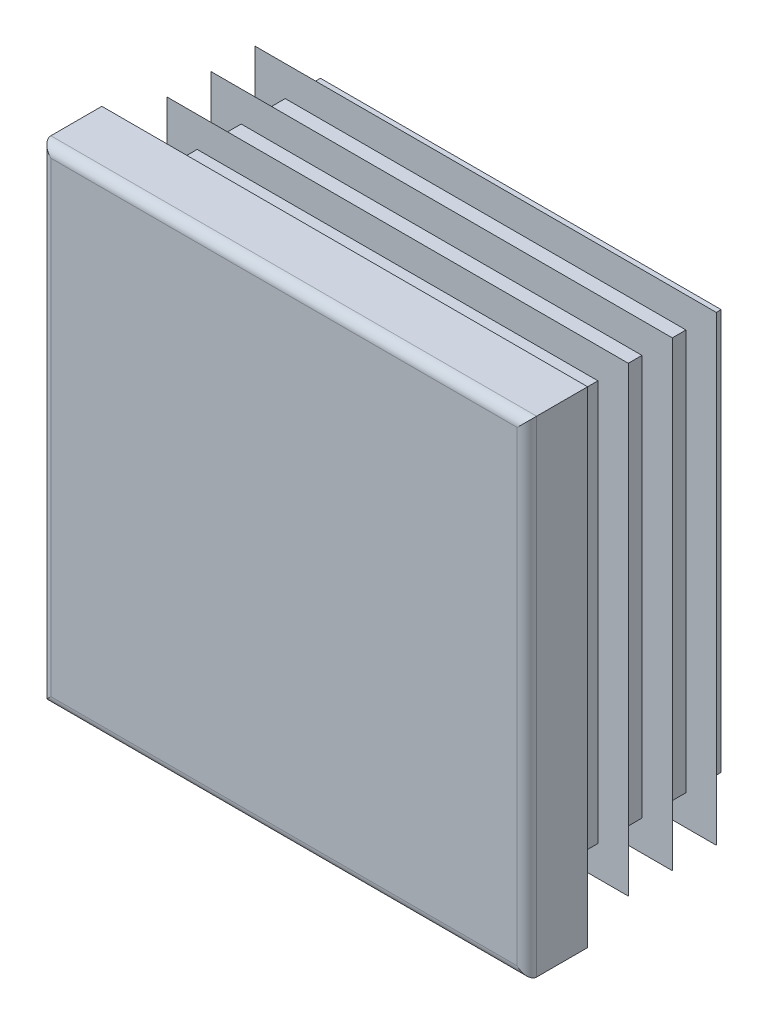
ISO-10303-21;
HEADER;
FILE_DESCRIPTION(('STEP AP214'),'2;1');
FILE_NAME('part.step','',(''),(''),'','','');
FILE_SCHEMA(('AUTOMOTIVE_DESIGN { 1 0 10303 214 1 1 1 1 }'));
ENDSEC;
DATA;
#1=APPLICATION_CONTEXT('core data for automotive mechanical design processes');
#2=APPLICATION_PROTOCOL_DEFINITION('international standard','automotive_design',2000,#1);
#3=PRODUCT_CONTEXT('',#1,'mechanical');
#4=PRODUCT('Part','Part','',(#3));
#5=PRODUCT_RELATED_PRODUCT_CATEGORY('part','',(#4));
#6=PRODUCT_DEFINITION_FORMATION('','',#4);
#7=PRODUCT_DEFINITION_CONTEXT('part definition',#1,'design');
#8=PRODUCT_DEFINITION('design','',#6,#7);
#9=PRODUCT_DEFINITION_SHAPE('','',#8);
#10=(LENGTH_UNIT() NAMED_UNIT(*) SI_UNIT(.MILLI.,.METRE.));
#11=(NAMED_UNIT(*) PLANE_ANGLE_UNIT() SI_UNIT($,.RADIAN.));
#12=(NAMED_UNIT(*) SI_UNIT($,.STERADIAN.) SOLID_ANGLE_UNIT());
#13=UNCERTAINTY_MEASURE_WITH_UNIT(LENGTH_MEASURE(1.E-05),#10,'distance_accuracy_value','');
#14=(GEOMETRIC_REPRESENTATION_CONTEXT(3) GLOBAL_UNCERTAINTY_ASSIGNED_CONTEXT((#13)) GLOBAL_UNIT_ASSIGNED_CONTEXT((#10,
#11,#12)) REPRESENTATION_CONTEXT('',''));
#15=CARTESIAN_POINT('',(0.,0.,0.));
#16=DIRECTION('',(0.,0.,1.));
#17=DIRECTION('',(1.,0.,0.));
#18=AXIS2_PLACEMENT_3D('',#15,#16,#17);
#19=CARTESIAN_POINT('',(19.2,-20.,5.));
#20=DIRECTION('',(0.,0.,-1.));
#21=DIRECTION('',(0.,1.,0.));
#22=AXIS2_PLACEMENT_3D('',#19,#20,#21);
#23=PLANE('',#22);
#24=DIRECTION('',(0.,1.,0.));
#25=VECTOR('',#24,1.);
#26=CARTESIAN_POINT('',(-19.2,-20.,5.));
#27=LINE('',#26,#25);
#28=CARTESIAN_POINT('',(-19.2,-19.2,5.));
#29=VERTEX_POINT('',#28);
#30=CARTESIAN_POINT('',(-19.2,19.2,5.));
#31=VERTEX_POINT('',#30);
#32=EDGE_CURVE('E262',#29,#31,#27,.T.);
#33=ORIENTED_EDGE('',*,*,#32,.F.);
#34=DIRECTION('',(-1.,0.,0.));
#35=VECTOR('',#34,1.);
#36=CARTESIAN_POINT('',(20.,-19.2,5.));
#37=LINE('',#36,#35);
#38=CARTESIAN_POINT('',(19.2,-19.2,5.));
#39=VERTEX_POINT('',#38);
#40=EDGE_CURVE('E432',#39,#29,#37,.T.);
#41=ORIENTED_EDGE('',*,*,#40,.F.);
#42=DIRECTION('',(0.,1.,0.));
#43=VECTOR('',#42,1.);
#44=CARTESIAN_POINT('',(19.2,-20.,5.));
#45=LINE('',#44,#43);
#46=CARTESIAN_POINT('',(19.2,19.2,5.));
#47=VERTEX_POINT('',#46);
#48=EDGE_CURVE('E257',#39,#47,#45,.T.);
#49=ORIENTED_EDGE('',*,*,#48,.T.);
#50=DIRECTION('',(-1.,0.,0.));
#51=VECTOR('',#50,1.);
#52=CARTESIAN_POINT('',(20.,19.2,5.));
#53=LINE('',#52,#51);
#54=EDGE_CURVE('E534',#47,#31,#53,.T.);
#55=ORIENTED_EDGE('',*,*,#54,.T.);
#56=EDGE_LOOP('',(#33,#41,#49,#55));
#57=FACE_BOUND('',#56,.T.);
#58=ADVANCED_FACE('F14',(#57),#23,.F.);
#59=CARTESIAN_POINT('',(-19.2,-20.,4.2));
#60=DIRECTION('',(0.,1.,0.));
#61=DIRECTION('',(-1.,0.,0.));
#62=AXIS2_PLACEMENT_3D('',#59,#60,#61);
#63=CYLINDRICAL_SURFACE('',#62,0.8);
#64=DIRECTION('',(0.,1.,0.));
#65=VECTOR('',#64,1.);
#66=CARTESIAN_POINT('',(-20.,-20.,4.2));
#67=LINE('',#66,#65);
#68=CARTESIAN_POINT('',(-20.,-20.,4.2));
#69=VERTEX_POINT('',#68);
#70=CARTESIAN_POINT('',(-20.,20.,4.2));
#71=VERTEX_POINT('',#70);
#72=EDGE_CURVE('E354',#69,#71,#67,.T.);
#73=ORIENTED_EDGE('',*,*,#72,.F.);
#74=CARTESIAN_POINT('',(-19.2,-19.2,4.2));
#75=DIRECTION('',(-0.707106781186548,0.707106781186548,0.));
#76=DIRECTION('',(0.707106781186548,0.707106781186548,0.));
#77=AXIS2_PLACEMENT_3D('',#74,#75,#76);
#78=ELLIPSE('',#77,1.13137084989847,0.8);
#79=EDGE_CURVE('E59',#69,#29,#78,.T.);
#80=ORIENTED_EDGE('',*,*,#79,.T.);
#81=ORIENTED_EDGE('',*,*,#32,.T.);
#82=CARTESIAN_POINT('',(-19.2,19.2,4.2));
#83=DIRECTION('',(0.707106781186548,0.707106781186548,0.));
#84=DIRECTION('',(-0.707106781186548,0.707106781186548,0.));
#85=AXIS2_PLACEMENT_3D('',#82,#83,#84);
#86=ELLIPSE('',#85,1.13137084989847,0.8);
#87=EDGE_CURVE('E258',#31,#71,#86,.F.);
#88=ORIENTED_EDGE('',*,*,#87,.T.);
#89=EDGE_LOOP('',(#73,#80,#81,#88));
#90=FACE_BOUND('',#89,.T.);
#91=ADVANCED_FACE('F16',(#90),#63,.T.);
#92=CARTESIAN_POINT('',(-20.,-20.,4.2));
#93=DIRECTION('',(1.,0.,0.));
#94=DIRECTION('',(0.,1.,0.));
#95=AXIS2_PLACEMENT_3D('',#92,#93,#94);
#96=PLANE('',#95);
#97=DIRECTION('',(0.,0.,-1.));
#98=VECTOR('',#97,1.);
#99=CARTESIAN_POINT('',(-20.,20.,4.2));
#100=LINE('',#99,#98);
#101=CARTESIAN_POINT('',(-20.,20.,0.));
#102=VERTEX_POINT('',#101);
#103=EDGE_CURVE('E519',#71,#102,#100,.T.);
#104=ORIENTED_EDGE('',*,*,#103,.T.);
#105=DIRECTION('',(0.,1.,0.));
#106=VECTOR('',#105,1.);
#107=CARTESIAN_POINT('',(-20.,-20.,0.));
#108=LINE('',#107,#106);
#109=CARTESIAN_POINT('',(-20.,-20.,0.));
#110=VERTEX_POINT('',#109);
#111=EDGE_CURVE('E352',#110,#102,#108,.T.);
#112=ORIENTED_EDGE('',*,*,#111,.F.);
#113=DIRECTION('',(0.,0.,-1.));
#114=VECTOR('',#113,1.);
#115=CARTESIAN_POINT('',(-20.,-20.,4.2));
#116=LINE('',#115,#114);
#117=EDGE_CURVE('E520',#69,#110,#116,.T.);
#118=ORIENTED_EDGE('',*,*,#117,.F.);
#119=ORIENTED_EDGE('',*,*,#72,.T.);
#120=EDGE_LOOP('',(#104,#112,#118,#119));
#121=FACE_BOUND('',#120,.T.);
#122=ADVANCED_FACE('F604',(#121),#96,.F.);
#123=CARTESIAN_POINT('',(-16.5,-20.,0.));
#124=DIRECTION('',(1.,0.,0.));
#125=DIRECTION('',(0.,1.,0.));
#126=AXIS2_PLACEMENT_3D('',#123,#124,#125);
#127=PLANE('',#126);
#128=DIRECTION('',(0.,1.,0.));
#129=VECTOR('',#128,1.);
#130=CARTESIAN_POINT('',(-16.5,-20.,0.));
#131=LINE('',#130,#129);
#132=CARTESIAN_POINT('',(-16.5,-16.5,0.));
#133=VERTEX_POINT('',#132);
#134=CARTESIAN_POINT('',(-16.5,16.5,0.));
#135=VERTEX_POINT('',#134);
#136=EDGE_CURVE('E349',#133,#135,#131,.T.);
#137=ORIENTED_EDGE('',*,*,#136,.T.);
#138=DIRECTION('',(0.,0.,-1.));
#139=VECTOR('',#138,1.);
#140=CARTESIAN_POINT('',(-16.5,16.5,0.));
#141=LINE('',#140,#139);
#142=CARTESIAN_POINT('',(-16.5,16.5,-0.725));
#143=VERTEX_POINT('',#142);
#144=EDGE_CURVE('E445',#135,#143,#141,.T.);
#145=ORIENTED_EDGE('',*,*,#144,.T.);
#146=DIRECTION('',(0.,1.,0.));
#147=VECTOR('',#146,1.);
#148=CARTESIAN_POINT('',(-16.5,-20.,-0.725));
#149=LINE('',#148,#147);
#150=CARTESIAN_POINT('',(-16.5,-16.5,-0.725));
#151=VERTEX_POINT('',#150);
#152=EDGE_CURVE('E346',#151,#143,#149,.T.);
#153=ORIENTED_EDGE('',*,*,#152,.F.);
#154=DIRECTION('',(0.,0.,1.));
#155=VECTOR('',#154,1.);
#156=CARTESIAN_POINT('',(-16.5,-16.5,0.));
#157=LINE('',#156,#155);
#158=EDGE_CURVE('E439',#151,#133,#157,.T.);
#159=ORIENTED_EDGE('',*,*,#158,.T.);
#160=EDGE_LOOP('',(#137,#145,#153,#159));
#161=FACE_BOUND('',#160,.T.);
#162=ADVANCED_FACE('F728',(#161),#127,.F.);
#163=CARTESIAN_POINT('',(-19.,-20.,-0.725));
#164=DIRECTION('',(0.573576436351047,0.,0.819152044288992));
#165=DIRECTION('',(-0.819152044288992,0.,0.573576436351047));
#166=AXIS2_PLACEMENT_3D('',#163,#164,#165);
#167=PLANE('',#166);
#168=DIRECTION('',(0.,1.,0.));
#169=VECTOR('',#168,1.);
#170=CARTESIAN_POINT('',(-19.,-20.,-0.725));
#171=LINE('',#170,#169);
#172=CARTESIAN_POINT('',(-19.,-19.,-0.725));
#173=VERTEX_POINT('',#172);
#174=CARTESIAN_POINT('',(-19.,19.,-0.725));
#175=VERTEX_POINT('',#174);
#176=EDGE_CURVE('E344',#173,#175,#171,.T.);
#177=ORIENTED_EDGE('',*,*,#176,.T.);
#178=DIRECTION('',(0.633687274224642,-0.633687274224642,-0.443712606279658));
#179=VECTOR('',#178,1.);
#180=CARTESIAN_POINT('',(-3.33917710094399,3.33917710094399,-11.6908262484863));
#181=LINE('',#180,#179);
#182=CARTESIAN_POINT('',(-16.5,16.5,-2.47551884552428));
#183=VERTEX_POINT('',#182);
#184=EDGE_CURVE('E457',#175,#183,#181,.T.);
#185=ORIENTED_EDGE('',*,*,#184,.T.);
#186=DIRECTION('',(0.,1.,0.));
#187=VECTOR('',#186,1.);
#188=CARTESIAN_POINT('',(-16.5,-20.,-2.47551884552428));
#189=LINE('',#188,#187);
#190=CARTESIAN_POINT('',(-16.5,-16.5,-2.47551884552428));
#191=VERTEX_POINT('',#190);
#192=EDGE_CURVE('E341',#191,#183,#189,.T.);
#193=ORIENTED_EDGE('',*,*,#192,.F.);
#194=DIRECTION('',(-0.633687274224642,-0.633687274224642,0.443712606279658));
#195=VECTOR('',#194,1.);
#196=CARTESIAN_POINT('',(-19.4015595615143,-19.4015595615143,-0.443824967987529));
#197=LINE('',#196,#195);
#198=EDGE_CURVE('E451',#191,#173,#197,.T.);
#199=ORIENTED_EDGE('',*,*,#198,.T.);
#200=EDGE_LOOP('',(#177,#185,#193,#199));
#201=FACE_BOUND('',#200,.T.);
#202=ADVANCED_FACE('F732',(#201),#167,.F.);
#203=CARTESIAN_POINT('',(-16.5,-20.,-2.47551884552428));
#204=DIRECTION('',(1.,0.,0.));
#205=DIRECTION('',(0.,1.,0.));
#206=AXIS2_PLACEMENT_3D('',#203,#204,#205);
#207=PLANE('',#206);
#208=ORIENTED_EDGE('',*,*,#192,.T.);
#209=DIRECTION('',(0.,0.,-1.));
#210=VECTOR('',#209,1.);
#211=CARTESIAN_POINT('',(-16.5,16.5,-2.47551884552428));
#212=LINE('',#211,#210);
#213=CARTESIAN_POINT('',(-16.5,16.5,-4.35));
#214=VERTEX_POINT('',#213);
#215=EDGE_CURVE('E463',#183,#214,#212,.T.);
#216=ORIENTED_EDGE('',*,*,#215,.T.);
#217=DIRECTION('',(0.,1.,0.));
#218=VECTOR('',#217,1.);
#219=CARTESIAN_POINT('',(-16.5,-20.,-4.35));
#220=LINE('',#219,#218);
#221=CARTESIAN_POINT('',(-16.5,-16.5,-4.35));
#222=VERTEX_POINT('',#221);
#223=EDGE_CURVE('E338',#222,#214,#220,.T.);
#224=ORIENTED_EDGE('',*,*,#223,.F.);
#225=DIRECTION('',(0.,0.,1.));
#226=VECTOR('',#225,1.);
#227=CARTESIAN_POINT('',(-16.5,-16.5,-2.47551884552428));
#228=LINE('',#227,#226);
#229=EDGE_CURVE('E460',#222,#191,#228,.T.);
#230=ORIENTED_EDGE('',*,*,#229,.T.);
#231=EDGE_LOOP('',(#208,#216,#224,#230));
#232=FACE_BOUND('',#231,.T.);
#233=ADVANCED_FACE('F738',(#232),#207,.F.);
#234=CARTESIAN_POINT('',(-19.,-20.,-4.35));
#235=DIRECTION('',(0.573576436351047,0.,0.819152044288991));
#236=DIRECTION('',(-0.819152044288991,0.,0.573576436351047));
#237=AXIS2_PLACEMENT_3D('',#234,#235,#236);
#238=PLANE('',#237);
#239=DIRECTION('',(0.,1.,0.));
#240=VECTOR('',#239,1.);
#241=CARTESIAN_POINT('',(-19.,-20.,-4.35));
#242=LINE('',#241,#240);
#243=CARTESIAN_POINT('',(-19.,-19.,-4.35));
#244=VERTEX_POINT('',#243);
#245=CARTESIAN_POINT('',(-19.,19.,-4.35));
#246=VERTEX_POINT('',#245);
#247=EDGE_CURVE('E336',#244,#246,#242,.T.);
#248=ORIENTED_EDGE('',*,*,#247,.T.);
#249=DIRECTION('',(0.633687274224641,-0.633687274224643,-0.443712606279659));
#250=VECTOR('',#249,1.);
#251=CARTESIAN_POINT('',(-3.33917710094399,3.33917710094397,-15.3158262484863));
#252=LINE('',#251,#250);
#253=CARTESIAN_POINT('',(-16.5,16.5,-6.10051884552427));
#254=VERTEX_POINT('',#253);
#255=EDGE_CURVE('E475',#246,#254,#252,.T.);
#256=ORIENTED_EDGE('',*,*,#255,.T.);
#257=DIRECTION('',(0.,1.,0.));
#258=VECTOR('',#257,1.);
#259=CARTESIAN_POINT('',(-16.5,-20.,-6.10051884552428));
#260=LINE('',#259,#258);
#261=CARTESIAN_POINT('',(-16.5,-16.5,-6.10051884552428));
#262=VERTEX_POINT('',#261);
#263=EDGE_CURVE('E333',#262,#254,#260,.T.);
#264=ORIENTED_EDGE('',*,*,#263,.F.);
#265=DIRECTION('',(-0.633687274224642,-0.633687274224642,0.443712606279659));
#266=VECTOR('',#265,1.);
#267=CARTESIAN_POINT('',(-19.4015595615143,-19.4015595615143,-4.06882496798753));
#268=LINE('',#267,#266);
#269=EDGE_CURVE('E469',#262,#244,#268,.T.);
#270=ORIENTED_EDGE('',*,*,#269,.T.);
#271=EDGE_LOOP('',(#248,#256,#264,#270));
#272=FACE_BOUND('',#271,.T.);
#273=ADVANCED_FACE('F742',(#272),#238,.F.);
#274=CARTESIAN_POINT('',(-16.5,-20.,-6.10051884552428));
#275=DIRECTION('',(1.,0.,0.));
#276=DIRECTION('',(0.,1.,0.));
#277=AXIS2_PLACEMENT_3D('',#274,#275,#276);
#278=PLANE('',#277);
#279=ORIENTED_EDGE('',*,*,#263,.T.);
#280=DIRECTION('',(0.,0.,-1.));
#281=VECTOR('',#280,1.);
#282=CARTESIAN_POINT('',(-16.5,16.5,-6.10051884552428));
#283=LINE('',#282,#281);
#284=CARTESIAN_POINT('',(-16.5,16.5,-7.975));
#285=VERTEX_POINT('',#284);
#286=EDGE_CURVE('E481',#254,#285,#283,.T.);
#287=ORIENTED_EDGE('',*,*,#286,.T.);
#288=DIRECTION('',(0.,1.,0.));
#289=VECTOR('',#288,1.);
#290=CARTESIAN_POINT('',(-16.5,-20.,-7.975));
#291=LINE('',#290,#289);
#292=CARTESIAN_POINT('',(-16.5,-16.5,-7.975));
#293=VERTEX_POINT('',#292);
#294=EDGE_CURVE('E330',#293,#285,#291,.T.);
#295=ORIENTED_EDGE('',*,*,#294,.F.);
#296=DIRECTION('',(0.,0.,1.));
#297=VECTOR('',#296,1.);
#298=CARTESIAN_POINT('',(-16.5,-16.5,-6.10051884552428));
#299=LINE('',#298,#297);
#300=EDGE_CURVE('E478',#293,#262,#299,.T.);
#301=ORIENTED_EDGE('',*,*,#300,.T.);
#302=EDGE_LOOP('',(#279,#287,#295,#301));
#303=FACE_BOUND('',#302,.T.);
#304=ADVANCED_FACE('F746',(#303),#278,.F.);
#305=CARTESIAN_POINT('',(-19.,-20.,-7.975));
#306=DIRECTION('',(0.573576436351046,0.,0.819152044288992));
#307=DIRECTION('',(-0.819152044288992,0.,0.573576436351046));
#308=AXIS2_PLACEMENT_3D('',#305,#306,#307);
#309=PLANE('',#308);
#310=DIRECTION('',(0.,1.,0.));
#311=VECTOR('',#310,1.);
#312=CARTESIAN_POINT('',(-19.,-20.,-7.975));
#313=LINE('',#312,#311);
#314=CARTESIAN_POINT('',(-19.,-19.,-7.975));
#315=VERTEX_POINT('',#314);
#316=CARTESIAN_POINT('',(-19.,19.,-7.975));
#317=VERTEX_POINT('',#316);
#318=EDGE_CURVE('E328',#315,#317,#313,.T.);
#319=ORIENTED_EDGE('',*,*,#318,.T.);
#320=DIRECTION('',(0.633687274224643,-0.633687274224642,-0.443712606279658));
#321=VECTOR('',#320,1.);
#322=CARTESIAN_POINT('',(-3.33917710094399,3.33917710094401,-18.9408262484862));
#323=LINE('',#322,#321);
#324=CARTESIAN_POINT('',(-16.5,16.5,-9.72551884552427));
#325=VERTEX_POINT('',#324);
#326=EDGE_CURVE('E493',#317,#325,#323,.T.);
#327=ORIENTED_EDGE('',*,*,#326,.T.);
#328=DIRECTION('',(0.,1.,0.));
#329=VECTOR('',#328,1.);
#330=CARTESIAN_POINT('',(-16.5,-20.,-9.72551884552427));
#331=LINE('',#330,#329);
#332=CARTESIAN_POINT('',(-16.5,-16.5,-9.72551884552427));
#333=VERTEX_POINT('',#332);
#334=EDGE_CURVE('E325',#333,#325,#331,.T.);
#335=ORIENTED_EDGE('',*,*,#334,.F.);
#336=DIRECTION('',(-0.633687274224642,-0.633687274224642,0.443712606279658));
#337=VECTOR('',#336,1.);
#338=CARTESIAN_POINT('',(-19.4015595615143,-19.4015595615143,-7.69382496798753));
#339=LINE('',#338,#337);
#340=EDGE_CURVE('E487',#333,#315,#339,.T.);
#341=ORIENTED_EDGE('',*,*,#340,.T.);
#342=EDGE_LOOP('',(#319,#327,#335,#341));
#343=FACE_BOUND('',#342,.T.);
#344=ADVANCED_FACE('F668',(#343),#309,.F.);
#345=CARTESIAN_POINT('',(-16.5,-20.,-9.72551884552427));
#346=DIRECTION('',(1.,0.,0.));
#347=DIRECTION('',(0.,1.,0.));
#348=AXIS2_PLACEMENT_3D('',#345,#346,#347);
#349=PLANE('',#348);
#350=ORIENTED_EDGE('',*,*,#334,.T.);
#351=DIRECTION('',(0.,0.,-1.));
#352=VECTOR('',#351,1.);
#353=CARTESIAN_POINT('',(-16.5,16.5,-9.72551884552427));
#354=LINE('',#353,#352);
#355=CARTESIAN_POINT('',(-16.5,16.5,-11.6));
#356=VERTEX_POINT('',#355);
#357=EDGE_CURVE('E499',#325,#356,#354,.T.);
#358=ORIENTED_EDGE('',*,*,#357,.T.);
#359=DIRECTION('',(0.,1.,0.));
#360=VECTOR('',#359,1.);
#361=CARTESIAN_POINT('',(-16.5,-20.,-11.6));
#362=LINE('',#361,#360);
#363=CARTESIAN_POINT('',(-16.5,-16.5,-11.6));
#364=VERTEX_POINT('',#363);
#365=EDGE_CURVE('E322',#364,#356,#362,.T.);
#366=ORIENTED_EDGE('',*,*,#365,.F.);
#367=DIRECTION('',(0.,0.,1.));
#368=VECTOR('',#367,1.);
#369=CARTESIAN_POINT('',(-16.5,-16.5,-9.72551884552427));
#370=LINE('',#369,#368);
#371=EDGE_CURVE('E496',#364,#333,#370,.T.);
#372=ORIENTED_EDGE('',*,*,#371,.T.);
#373=EDGE_LOOP('',(#350,#358,#366,#372));
#374=FACE_BOUND('',#373,.T.);
#375=ADVANCED_FACE('F665',(#374),#349,.F.);
#376=CARTESIAN_POINT('',(-19.,-20.,-11.6));
#377=DIRECTION('',(0.573576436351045,0.,0.819152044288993));
#378=DIRECTION('',(-0.819152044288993,0.,0.573576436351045));
#379=AXIS2_PLACEMENT_3D('',#376,#377,#378);
#380=PLANE('',#379);
#381=DIRECTION('',(0.,1.,0.));
#382=VECTOR('',#381,1.);
#383=CARTESIAN_POINT('',(-19.,-20.,-11.6));
#384=LINE('',#383,#382);
#385=CARTESIAN_POINT('',(-19.,-19.,-11.6));
#386=VERTEX_POINT('',#385);
#387=CARTESIAN_POINT('',(-19.,19.,-11.6));
#388=VERTEX_POINT('',#387);
#389=EDGE_CURVE('E320',#386,#388,#384,.T.);
#390=ORIENTED_EDGE('',*,*,#389,.T.);
#391=DIRECTION('',(0.633687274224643,-0.633687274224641,-0.443712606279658));
#392=VECTOR('',#391,1.);
#393=CARTESIAN_POINT('',(-3.33917710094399,3.33917710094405,-22.5658262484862));
#394=LINE('',#393,#392);
#395=CARTESIAN_POINT('',(-16.5,16.5,-13.3505188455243));
#396=VERTEX_POINT('',#395);
#397=EDGE_CURVE('E511',#388,#396,#394,.T.);
#398=ORIENTED_EDGE('',*,*,#397,.T.);
#399=DIRECTION('',(0.,1.,0.));
#400=VECTOR('',#399,1.);
#401=CARTESIAN_POINT('',(-16.5,-20.,-13.3505188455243));
#402=LINE('',#401,#400);
#403=CARTESIAN_POINT('',(-16.5,-16.5,-13.3505188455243));
#404=VERTEX_POINT('',#403);
#405=EDGE_CURVE('E317',#404,#396,#402,.T.);
#406=ORIENTED_EDGE('',*,*,#405,.F.);
#407=DIRECTION('',(-0.633687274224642,-0.633687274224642,0.443712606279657));
#408=VECTOR('',#407,1.);
#409=CARTESIAN_POINT('',(-19.4015595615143,-19.4015595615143,-11.3188249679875));
#410=LINE('',#409,#408);
#411=EDGE_CURVE('E505',#404,#386,#410,.T.);
#412=ORIENTED_EDGE('',*,*,#411,.T.);
#413=EDGE_LOOP('',(#390,#398,#406,#412));
#414=FACE_BOUND('',#413,.T.);
#415=ADVANCED_FACE('F580',(#414),#380,.F.);
#416=CARTESIAN_POINT('',(-16.5,-20.,-13.3505188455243));
#417=DIRECTION('',(1.,0.,0.));
#418=DIRECTION('',(0.,1.,0.));
#419=AXIS2_PLACEMENT_3D('',#416,#417,#418);
#420=PLANE('',#419);
#421=ORIENTED_EDGE('',*,*,#405,.T.);
#422=DIRECTION('',(0.,0.,-1.));
#423=VECTOR('',#422,1.);
#424=CARTESIAN_POINT('',(-16.5,16.5,-13.3505188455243));
#425=LINE('',#424,#423);
#426=CARTESIAN_POINT('',(-16.5,16.5,-14.5));
#427=VERTEX_POINT('',#426);
#428=EDGE_CURVE('E517',#396,#427,#425,.T.);
#429=ORIENTED_EDGE('',*,*,#428,.T.);
#430=DIRECTION('',(0.,1.,0.));
#431=VECTOR('',#430,1.);
#432=CARTESIAN_POINT('',(-16.5,-20.,-14.5));
#433=LINE('',#432,#431);
#434=CARTESIAN_POINT('',(-16.5,-16.5,-14.5));
#435=VERTEX_POINT('',#434);
#436=EDGE_CURVE('E314',#435,#427,#433,.T.);
#437=ORIENTED_EDGE('',*,*,#436,.F.);
#438=DIRECTION('',(0.,0.,1.));
#439=VECTOR('',#438,1.);
#440=CARTESIAN_POINT('',(-16.5,-16.5,-13.3505188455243));
#441=LINE('',#440,#439);
#442=EDGE_CURVE('E514',#435,#404,#441,.T.);
#443=ORIENTED_EDGE('',*,*,#442,.T.);
#444=EDGE_LOOP('',(#421,#429,#437,#443));
#445=FACE_BOUND('',#444,.T.);
#446=ADVANCED_FACE('F582',(#445),#420,.F.);
#447=CARTESIAN_POINT('',(-16.5,-20.,-14.5));
#448=DIRECTION('',(0.,0.,1.));
#449=DIRECTION('',(0.,-1.,0.));
#450=AXIS2_PLACEMENT_3D('',#447,#448,#449);
#451=PLANE('',#450);
#452=ORIENTED_EDGE('',*,*,#436,.T.);
#453=DIRECTION('',(-1.,0.,0.));
#454=VECTOR('',#453,1.);
#455=CARTESIAN_POINT('',(20.,16.5,-14.5));
#456=LINE('',#455,#454);
#457=CARTESIAN_POINT('',(16.5,16.5,-14.5));
#458=VERTEX_POINT('',#457);
#459=EDGE_CURVE('E388',#458,#427,#456,.T.);
#460=ORIENTED_EDGE('',*,*,#459,.F.);
#461=DIRECTION('',(0.,1.,0.));
#462=VECTOR('',#461,1.);
#463=CARTESIAN_POINT('',(16.5,-20.,-14.5));
#464=LINE('',#463,#462);
#465=CARTESIAN_POINT('',(16.5,-16.5,-14.5));
#466=VERTEX_POINT('',#465);
#467=EDGE_CURVE('E311',#466,#458,#464,.T.);
#468=ORIENTED_EDGE('',*,*,#467,.F.);
#469=DIRECTION('',(-1.,0.,0.));
#470=VECTOR('',#469,1.);
#471=CARTESIAN_POINT('',(20.,-16.5,-14.5));
#472=LINE('',#471,#470);
#473=EDGE_CURVE('E386',#466,#435,#472,.T.);
#474=ORIENTED_EDGE('',*,*,#473,.T.);
#475=EDGE_LOOP('',(#452,#460,#468,#474));
#476=FACE_BOUND('',#475,.T.);
#477=ADVANCED_FACE('F385',(#476),#451,.F.);
#478=CARTESIAN_POINT('',(16.5,-20.,-14.5));
#479=DIRECTION('',(-1.,0.,0.));
#480=DIRECTION('',(0.,-1.,0.));
#481=AXIS2_PLACEMENT_3D('',#478,#479,#480);
#482=PLANE('',#481);
#483=ORIENTED_EDGE('',*,*,#467,.T.);
#484=DIRECTION('',(0.,0.,1.));
#485=VECTOR('',#484,1.);
#486=CARTESIAN_POINT('',(16.5,16.5,-14.5));
#487=LINE('',#486,#485);
#488=CARTESIAN_POINT('',(16.5,16.5,-13.3505188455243));
#489=VERTEX_POINT('',#488);
#490=EDGE_CURVE('E9',#458,#489,#487,.T.);
#491=ORIENTED_EDGE('',*,*,#490,.T.);
#492=DIRECTION('',(0.,1.,0.));
#493=VECTOR('',#492,1.);
#494=CARTESIAN_POINT('',(16.5,-20.,-13.3505188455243));
#495=LINE('',#494,#493);
#496=CARTESIAN_POINT('',(16.5,-16.5,-13.3505188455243));
#497=VERTEX_POINT('',#496);
#498=EDGE_CURVE('E308',#497,#489,#495,.T.);
#499=ORIENTED_EDGE('',*,*,#498,.F.);
#500=DIRECTION('',(0.,0.,-1.));
#501=VECTOR('',#500,1.);
#502=CARTESIAN_POINT('',(16.5,-16.5,-14.5));
#503=LINE('',#502,#501);
#504=EDGE_CURVE('E23',#497,#466,#503,.T.);
#505=ORIENTED_EDGE('',*,*,#504,.T.);
#506=EDGE_LOOP('',(#483,#491,#499,#505));
#507=FACE_BOUND('',#506,.T.);
#508=ADVANCED_FACE('F378',(#507),#482,.F.);
#509=CARTESIAN_POINT('',(16.5,-20.,-13.3505188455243));
#510=DIRECTION('',(-0.573576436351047,0.,0.819152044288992));
#511=DIRECTION('',(-0.819152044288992,0.,-0.573576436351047));
#512=AXIS2_PLACEMENT_3D('',#509,#510,#511);
#513=PLANE('',#512);
#514=ORIENTED_EDGE('',*,*,#498,.T.);
#515=DIRECTION('',(0.633687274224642,0.633687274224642,0.443712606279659));
#516=VECTOR('',#515,1.);
#517=CARTESIAN_POINT('',(1.84307600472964,1.84307600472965,-23.6134075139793));
#518=LINE('',#517,#516);
#519=CARTESIAN_POINT('',(19.,19.,-11.6));
#520=VERTEX_POINT('',#519);
#521=EDGE_CURVE('E508',#489,#520,#518,.T.);
#522=ORIENTED_EDGE('',*,*,#521,.T.);
#523=DIRECTION('',(0.,1.,0.));
#524=VECTOR('',#523,1.);
#525=CARTESIAN_POINT('',(19.,-20.,-11.6));
#526=LINE('',#525,#524);
#527=CARTESIAN_POINT('',(19.,-19.,-11.6));
#528=VERTEX_POINT('',#527);
#529=EDGE_CURVE('E305',#528,#520,#526,.T.);
#530=ORIENTED_EDGE('',*,*,#529,.F.);
#531=DIRECTION('',(-0.633687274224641,0.633687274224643,-0.443712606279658));
#532=VECTOR('',#531,1.);
#533=CARTESIAN_POINT('',(17.9054584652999,-17.9054584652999,-12.3664062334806));
#534=LINE('',#533,#532);
#535=EDGE_CURVE('E502',#528,#497,#534,.T.);
#536=ORIENTED_EDGE('',*,*,#535,.T.);
#537=EDGE_LOOP('',(#514,#522,#530,#536));
#538=FACE_BOUND('',#537,.T.);
#539=ADVANCED_FACE('F588',(#538),#513,.F.);
#540=CARTESIAN_POINT('',(19.,-20.,-11.6));
#541=DIRECTION('',(0.,0.,-1.));
#542=DIRECTION('',(0.,1.,0.));
#543=AXIS2_PLACEMENT_3D('',#540,#541,#542);
#544=PLANE('',#543);
#545=ORIENTED_EDGE('',*,*,#529,.T.);
#546=DIRECTION('',(-1.,0.,0.));
#547=VECTOR('',#546,1.);
#548=CARTESIAN_POINT('',(20.,19.,-11.6));
#549=LINE('',#548,#547);
#550=EDGE_CURVE('E394',#520,#388,#549,.T.);
#551=ORIENTED_EDGE('',*,*,#550,.T.);
#552=ORIENTED_EDGE('',*,*,#389,.F.);
#553=DIRECTION('',(-1.,0.,0.));
#554=VECTOR('',#553,1.);
#555=CARTESIAN_POINT('',(20.,-19.,-11.6));
#556=LINE('',#555,#554);
#557=EDGE_CURVE('E401',#528,#386,#556,.T.);
#558=ORIENTED_EDGE('',*,*,#557,.F.);
#559=EDGE_LOOP('',(#545,#551,#552,#558));
#560=FACE_BOUND('',#559,.T.);
#561=ORIENTED_EDGE('',*,*,#365,.T.);
#562=DIRECTION('',(-1.,0.,0.));
#563=VECTOR('',#562,1.);
#564=CARTESIAN_POINT('',(20.,16.5,-11.6));
#565=LINE('',#564,#563);
#566=CARTESIAN_POINT('',(16.5,16.5,-11.6));
#567=VERTEX_POINT('',#566);
#568=EDGE_CURVE('E567',#567,#356,#565,.T.);
#569=ORIENTED_EDGE('',*,*,#568,.F.);
#570=DIRECTION('',(0.,1.,0.));
#571=VECTOR('',#570,1.);
#572=CARTESIAN_POINT('',(16.5,-20.,-11.6));
#573=LINE('',#572,#571);
#574=CARTESIAN_POINT('',(16.5,-16.5,-11.6));
#575=VERTEX_POINT('',#574);
#576=EDGE_CURVE('E302',#575,#567,#573,.T.);
#577=ORIENTED_EDGE('',*,*,#576,.F.);
#578=DIRECTION('',(-1.,0.,0.));
#579=VECTOR('',#578,1.);
#580=CARTESIAN_POINT('',(20.,-16.5,-11.6));
#581=LINE('',#580,#579);
#582=EDGE_CURVE('E403',#575,#364,#581,.T.);
#583=ORIENTED_EDGE('',*,*,#582,.T.);
#584=EDGE_LOOP('',(#561,#569,#577,#583));
#585=FACE_BOUND('',#584,.T.);
#586=ADVANCED_FACE('F571',(#560,#585),#544,.F.);
#587=CARTESIAN_POINT('',(16.5,-20.,-11.6));
#588=DIRECTION('',(-1.,0.,0.));
#589=DIRECTION('',(0.,-1.,0.));
#590=AXIS2_PLACEMENT_3D('',#587,#588,#589);
#591=PLANE('',#590);
#592=ORIENTED_EDGE('',*,*,#576,.T.);
#593=DIRECTION('',(0.,0.,1.));
#594=VECTOR('',#593,1.);
#595=CARTESIAN_POINT('',(16.5,16.5,-11.6));
#596=LINE('',#595,#594);
#597=CARTESIAN_POINT('',(16.5,16.5,-9.72551884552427));
#598=VERTEX_POINT('',#597);
#599=EDGE_CURVE('E372',#567,#598,#596,.T.);
#600=ORIENTED_EDGE('',*,*,#599,.T.);
#601=DIRECTION('',(0.,1.,0.));
#602=VECTOR('',#601,1.);
#603=CARTESIAN_POINT('',(16.5,-20.,-9.72551884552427));
#604=LINE('',#603,#602);
#605=CARTESIAN_POINT('',(16.5,-16.5,-9.72551884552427));
#606=VERTEX_POINT('',#605);
#607=EDGE_CURVE('E299',#606,#598,#604,.T.);
#608=ORIENTED_EDGE('',*,*,#607,.F.);
#609=DIRECTION('',(0.,0.,-1.));
#610=VECTOR('',#609,1.);
#611=CARTESIAN_POINT('',(16.5,-16.5,-11.6));
#612=LINE('',#611,#610);
#613=EDGE_CURVE('E369',#606,#575,#612,.T.);
#614=ORIENTED_EDGE('',*,*,#613,.T.);
#615=EDGE_LOOP('',(#592,#600,#608,#614));
#616=FACE_BOUND('',#615,.T.);
#617=ADVANCED_FACE('F596',(#616),#591,.F.);
#618=CARTESIAN_POINT('',(16.5,-20.,-9.72551884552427));
#619=DIRECTION('',(-0.573576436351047,0.,0.819152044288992));
#620=DIRECTION('',(-0.819152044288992,0.,-0.573576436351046));
#621=AXIS2_PLACEMENT_3D('',#618,#619,#620);
#622=PLANE('',#621);
#623=ORIENTED_EDGE('',*,*,#607,.T.);
#624=DIRECTION('',(0.633687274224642,0.633687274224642,0.443712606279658));
#625=VECTOR('',#624,1.);
#626=CARTESIAN_POINT('',(1.84307600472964,1.84307600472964,-19.9884075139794));
#627=LINE('',#626,#625);
#628=CARTESIAN_POINT('',(19.,19.,-7.975));
#629=VERTEX_POINT('',#628);
#630=EDGE_CURVE('E490',#598,#629,#627,.T.);
#631=ORIENTED_EDGE('',*,*,#630,.T.);
#632=DIRECTION('',(0.,1.,0.));
#633=VECTOR('',#632,1.);
#634=CARTESIAN_POINT('',(19.,-20.,-7.975));
#635=LINE('',#634,#633);
#636=CARTESIAN_POINT('',(19.,-19.,-7.975));
#637=VERTEX_POINT('',#636);
#638=EDGE_CURVE('E296',#637,#629,#635,.T.);
#639=ORIENTED_EDGE('',*,*,#638,.F.);
#640=DIRECTION('',(-0.633687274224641,0.633687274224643,-0.443712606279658));
#641=VECTOR('',#640,1.);
#642=CARTESIAN_POINT('',(17.9054584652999,-17.9054584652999,-8.74140623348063));
#643=LINE('',#642,#641);
#644=EDGE_CURVE('E484',#637,#606,#643,.T.);
#645=ORIENTED_EDGE('',*,*,#644,.T.);
#646=EDGE_LOOP('',(#623,#631,#639,#645));
#647=FACE_BOUND('',#646,.T.);
#648=ADVANCED_FACE('F648',(#647),#622,.F.);
#649=CARTESIAN_POINT('',(19.,-20.,-7.975));
#650=DIRECTION('',(0.,0.,-1.));
#651=DIRECTION('',(0.,1.,0.));
#652=AXIS2_PLACEMENT_3D('',#649,#650,#651);
#653=PLANE('',#652);
#654=ORIENTED_EDGE('',*,*,#638,.T.);
#655=DIRECTION('',(-1.,0.,0.));
#656=VECTOR('',#655,1.);
#657=CARTESIAN_POINT('',(20.,19.,-7.975));
#658=LINE('',#657,#656);
#659=EDGE_CURVE('E561',#629,#317,#658,.T.);
#660=ORIENTED_EDGE('',*,*,#659,.T.);
#661=ORIENTED_EDGE('',*,*,#318,.F.);
#662=DIRECTION('',(-1.,0.,0.));
#663=VECTOR('',#662,1.);
#664=CARTESIAN_POINT('',(20.,-19.,-7.975));
#665=LINE('',#664,#663);
#666=EDGE_CURVE('E409',#637,#315,#665,.T.);
#667=ORIENTED_EDGE('',*,*,#666,.F.);
#668=EDGE_LOOP('',(#654,#660,#661,#667));
#669=FACE_BOUND('',#668,.T.);
#670=ORIENTED_EDGE('',*,*,#294,.T.);
#671=DIRECTION('',(-1.,0.,0.));
#672=VECTOR('',#671,1.);
#673=CARTESIAN_POINT('',(20.,16.5,-7.975));
#674=LINE('',#673,#672);
#675=CARTESIAN_POINT('',(16.5,16.5,-7.975));
#676=VERTEX_POINT('',#675);
#677=EDGE_CURVE('E559',#676,#285,#674,.T.);
#678=ORIENTED_EDGE('',*,*,#677,.F.);
#679=DIRECTION('',(0.,1.,0.));
#680=VECTOR('',#679,1.);
#681=CARTESIAN_POINT('',(16.5,-20.,-7.975));
#682=LINE('',#681,#680);
#683=CARTESIAN_POINT('',(16.5,-16.5,-7.975));
#684=VERTEX_POINT('',#683);
#685=EDGE_CURVE('E293',#684,#676,#682,.T.);
#686=ORIENTED_EDGE('',*,*,#685,.F.);
#687=DIRECTION('',(-1.,0.,0.));
#688=VECTOR('',#687,1.);
#689=CARTESIAN_POINT('',(20.,-16.5,-7.975));
#690=LINE('',#689,#688);
#691=EDGE_CURVE('E411',#684,#293,#690,.T.);
#692=ORIENTED_EDGE('',*,*,#691,.T.);
#693=EDGE_LOOP('',(#670,#678,#686,#692));
#694=FACE_BOUND('',#693,.T.);
#695=ADVANCED_FACE('F644',(#669,#694),#653,.F.);
#696=CARTESIAN_POINT('',(16.5,-20.,-7.975));
#697=DIRECTION('',(-1.,0.,0.));
#698=DIRECTION('',(0.,-1.,0.));
#699=AXIS2_PLACEMENT_3D('',#696,#697,#698);
#700=PLANE('',#699);
#701=ORIENTED_EDGE('',*,*,#685,.T.);
#702=DIRECTION('',(0.,0.,1.));
#703=VECTOR('',#702,1.);
#704=CARTESIAN_POINT('',(16.5,16.5,-7.975));
#705=LINE('',#704,#703);
#706=CARTESIAN_POINT('',(16.5,16.5,-6.10051884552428));
#707=VERTEX_POINT('',#706);
#708=EDGE_CURVE('E366',#676,#707,#705,.T.);
#709=ORIENTED_EDGE('',*,*,#708,.T.);
#710=DIRECTION('',(0.,1.,0.));
#711=VECTOR('',#710,1.);
#712=CARTESIAN_POINT('',(16.5,-20.,-6.10051884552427));
#713=LINE('',#712,#711);
#714=CARTESIAN_POINT('',(16.5,-16.5,-6.10051884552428));
#715=VERTEX_POINT('',#714);
#716=EDGE_CURVE('E290',#715,#707,#713,.T.);
#717=ORIENTED_EDGE('',*,*,#716,.F.);
#718=DIRECTION('',(0.,0.,-1.));
#719=VECTOR('',#718,1.);
#720=CARTESIAN_POINT('',(16.5,-16.5,-7.975));
#721=LINE('',#720,#719);
#722=EDGE_CURVE('E363',#715,#684,#721,.T.);
#723=ORIENTED_EDGE('',*,*,#722,.T.);
#724=EDGE_LOOP('',(#701,#709,#717,#723));
#725=FACE_BOUND('',#724,.T.);
#726=ADVANCED_FACE('F640',(#725),#700,.F.);
#727=CARTESIAN_POINT('',(16.5,-20.,-6.10051884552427));
#728=DIRECTION('',(-0.573576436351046,0.,0.819152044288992));
#729=DIRECTION('',(-0.819152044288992,0.,-0.573576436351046));
#730=AXIS2_PLACEMENT_3D('',#727,#728,#729);
#731=PLANE('',#730);
#732=ORIENTED_EDGE('',*,*,#716,.T.);
#733=DIRECTION('',(0.633687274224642,0.633687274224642,0.443712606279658));
#734=VECTOR('',#733,1.);
#735=CARTESIAN_POINT('',(1.84307600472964,1.84307600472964,-16.3634075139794));
#736=LINE('',#735,#734);
#737=CARTESIAN_POINT('',(19.,19.,-4.35));
#738=VERTEX_POINT('',#737);
#739=EDGE_CURVE('E472',#707,#738,#736,.T.);
#740=ORIENTED_EDGE('',*,*,#739,.T.);
#741=DIRECTION('',(0.,1.,0.));
#742=VECTOR('',#741,1.);
#743=CARTESIAN_POINT('',(19.,-20.,-4.35));
#744=LINE('',#743,#742);
#745=CARTESIAN_POINT('',(19.,-19.,-4.35));
#746=VERTEX_POINT('',#745);
#747=EDGE_CURVE('E287',#746,#738,#744,.T.);
#748=ORIENTED_EDGE('',*,*,#747,.F.);
#749=DIRECTION('',(-0.633687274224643,0.633687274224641,-0.443712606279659));
#750=VECTOR('',#749,1.);
#751=CARTESIAN_POINT('',(17.9054584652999,-17.9054584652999,-5.11640623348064));
#752=LINE('',#751,#750);
#753=EDGE_CURVE('E466',#746,#715,#752,.T.);
#754=ORIENTED_EDGE('',*,*,#753,.T.);
#755=EDGE_LOOP('',(#732,#740,#748,#754));
#756=FACE_BOUND('',#755,.T.);
#757=ADVANCED_FACE('F636',(#756),#731,.F.);
#758=CARTESIAN_POINT('',(19.,-20.,-4.35));
#759=DIRECTION('',(0.,0.,-1.));
#760=DIRECTION('',(0.,1.,0.));
#761=AXIS2_PLACEMENT_3D('',#758,#759,#760);
#762=PLANE('',#761);
#763=ORIENTED_EDGE('',*,*,#747,.T.);
#764=DIRECTION('',(-1.,0.,0.));
#765=VECTOR('',#764,1.);
#766=CARTESIAN_POINT('',(20.,19.,-4.35));
#767=LINE('',#766,#765);
#768=EDGE_CURVE('E553',#738,#246,#767,.T.);
#769=ORIENTED_EDGE('',*,*,#768,.T.);
#770=ORIENTED_EDGE('',*,*,#247,.F.);
#771=DIRECTION('',(-1.,0.,0.));
#772=VECTOR('',#771,1.);
#773=CARTESIAN_POINT('',(20.,-19.,-4.35));
#774=LINE('',#773,#772);
#775=EDGE_CURVE('E417',#746,#244,#774,.T.);
#776=ORIENTED_EDGE('',*,*,#775,.F.);
#777=EDGE_LOOP('',(#763,#769,#770,#776));
#778=FACE_BOUND('',#777,.T.);
#779=ORIENTED_EDGE('',*,*,#223,.T.);
#780=DIRECTION('',(-1.,0.,0.));
#781=VECTOR('',#780,1.);
#782=CARTESIAN_POINT('',(20.,16.5,-4.35));
#783=LINE('',#782,#781);
#784=CARTESIAN_POINT('',(16.5,16.5,-4.35));
#785=VERTEX_POINT('',#784);
#786=EDGE_CURVE('E551',#785,#214,#783,.T.);
#787=ORIENTED_EDGE('',*,*,#786,.F.);
#788=DIRECTION('',(0.,1.,0.));
#789=VECTOR('',#788,1.);
#790=CARTESIAN_POINT('',(16.5,-20.,-4.35));
#791=LINE('',#790,#789);
#792=CARTESIAN_POINT('',(16.5,-16.5,-4.35));
#793=VERTEX_POINT('',#792);
#794=EDGE_CURVE('E284',#793,#785,#791,.T.);
#795=ORIENTED_EDGE('',*,*,#794,.F.);
#796=DIRECTION('',(-1.,0.,0.));
#797=VECTOR('',#796,1.);
#798=CARTESIAN_POINT('',(20.,-16.5,-4.35));
#799=LINE('',#798,#797);
#800=EDGE_CURVE('E419',#793,#222,#799,.T.);
#801=ORIENTED_EDGE('',*,*,#800,.T.);
#802=EDGE_LOOP('',(#779,#787,#795,#801));
#803=FACE_BOUND('',#802,.T.);
#804=ADVANCED_FACE('F632',(#778,#803),#762,.F.);
#805=CARTESIAN_POINT('',(16.5,-20.,-4.35));
#806=DIRECTION('',(-1.,0.,0.));
#807=DIRECTION('',(0.,-1.,0.));
#808=AXIS2_PLACEMENT_3D('',#805,#806,#807);
#809=PLANE('',#808);
#810=ORIENTED_EDGE('',*,*,#794,.T.);
#811=DIRECTION('',(0.,0.,1.));
#812=VECTOR('',#811,1.);
#813=CARTESIAN_POINT('',(16.5,16.5,-4.35));
#814=LINE('',#813,#812);
#815=CARTESIAN_POINT('',(16.5,16.5,-2.47551884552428));
#816=VERTEX_POINT('',#815);
#817=EDGE_CURVE('E360',#785,#816,#814,.T.);
#818=ORIENTED_EDGE('',*,*,#817,.T.);
#819=DIRECTION('',(0.,1.,0.));
#820=VECTOR('',#819,1.);
#821=CARTESIAN_POINT('',(16.5,-20.,-2.47551884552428));
#822=LINE('',#821,#820);
#823=CARTESIAN_POINT('',(16.5,-16.5,-2.47551884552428));
#824=VERTEX_POINT('',#823);
#825=EDGE_CURVE('E281',#824,#816,#822,.T.);
#826=ORIENTED_EDGE('',*,*,#825,.F.);
#827=DIRECTION('',(0.,0.,-1.));
#828=VECTOR('',#827,1.);
#829=CARTESIAN_POINT('',(16.5,-16.5,-4.35));
#830=LINE('',#829,#828);
#831=EDGE_CURVE('E357',#824,#793,#830,.T.);
#832=ORIENTED_EDGE('',*,*,#831,.T.);
#833=EDGE_LOOP('',(#810,#818,#826,#832));
#834=FACE_BOUND('',#833,.T.);
#835=ADVANCED_FACE('F628',(#834),#809,.F.);
#836=CARTESIAN_POINT('',(16.5,-20.,-2.47551884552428));
#837=DIRECTION('',(-0.573576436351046,0.,0.819152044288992));
#838=DIRECTION('',(-0.819152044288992,0.,-0.573576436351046));
#839=AXIS2_PLACEMENT_3D('',#836,#837,#838);
#840=PLANE('',#839);
#841=ORIENTED_EDGE('',*,*,#825,.T.);
#842=DIRECTION('',(0.633687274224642,0.633687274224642,0.443712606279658));
#843=VECTOR('',#842,1.);
#844=CARTESIAN_POINT('',(1.84307600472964,1.84307600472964,-12.7384075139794));
#845=LINE('',#844,#843);
#846=CARTESIAN_POINT('',(19.,19.,-0.725));
#847=VERTEX_POINT('',#846);
#848=EDGE_CURVE('E454',#816,#847,#845,.T.);
#849=ORIENTED_EDGE('',*,*,#848,.T.);
#850=DIRECTION('',(0.,1.,0.));
#851=VECTOR('',#850,1.);
#852=CARTESIAN_POINT('',(19.,-20.,-0.725));
#853=LINE('',#852,#851);
#854=CARTESIAN_POINT('',(19.,-19.,-0.725));
#855=VERTEX_POINT('',#854);
#856=EDGE_CURVE('E278',#855,#847,#853,.T.);
#857=ORIENTED_EDGE('',*,*,#856,.F.);
#858=DIRECTION('',(-0.633687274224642,0.633687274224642,-0.443712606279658));
#859=VECTOR('',#858,1.);
#860=CARTESIAN_POINT('',(17.9054584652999,-17.9054584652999,-1.49140623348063));
#861=LINE('',#860,#859);
#862=EDGE_CURVE('E448',#855,#824,#861,.T.);
#863=ORIENTED_EDGE('',*,*,#862,.T.);
#864=EDGE_LOOP('',(#841,#849,#857,#863));
#865=FACE_BOUND('',#864,.T.);
#866=ADVANCED_FACE('F624',(#865),#840,.F.);
#867=CARTESIAN_POINT('',(19.,-20.,-0.725));
#868=DIRECTION('',(0.,0.,-1.));
#869=DIRECTION('',(0.,1.,0.));
#870=AXIS2_PLACEMENT_3D('',#867,#868,#869);
#871=PLANE('',#870);
#872=ORIENTED_EDGE('',*,*,#856,.T.);
#873=DIRECTION('',(-1.,0.,0.));
#874=VECTOR('',#873,1.);
#875=CARTESIAN_POINT('',(20.,19.,-0.725));
#876=LINE('',#875,#874);
#877=EDGE_CURVE('E545',#847,#175,#876,.T.);
#878=ORIENTED_EDGE('',*,*,#877,.T.);
#879=ORIENTED_EDGE('',*,*,#176,.F.);
#880=DIRECTION('',(-1.,0.,0.));
#881=VECTOR('',#880,1.);
#882=CARTESIAN_POINT('',(20.,-19.,-0.725));
#883=LINE('',#882,#881);
#884=EDGE_CURVE('E425',#855,#173,#883,.T.);
#885=ORIENTED_EDGE('',*,*,#884,.F.);
#886=EDGE_LOOP('',(#872,#878,#879,#885));
#887=FACE_BOUND('',#886,.T.);
#888=ORIENTED_EDGE('',*,*,#152,.T.);
#889=DIRECTION('',(-1.,0.,0.));
#890=VECTOR('',#889,1.);
#891=CARTESIAN_POINT('',(20.,16.5,-0.725));
#892=LINE('',#891,#890);
#893=CARTESIAN_POINT('',(16.5,16.5,-0.725));
#894=VERTEX_POINT('',#893);
#895=EDGE_CURVE('E543',#894,#143,#892,.T.);
#896=ORIENTED_EDGE('',*,*,#895,.F.);
#897=DIRECTION('',(0.,1.,0.));
#898=VECTOR('',#897,1.);
#899=CARTESIAN_POINT('',(16.5,-20.,-0.725));
#900=LINE('',#899,#898);
#901=CARTESIAN_POINT('',(16.5,-16.5,-0.725));
#902=VERTEX_POINT('',#901);
#903=EDGE_CURVE('E275',#902,#894,#900,.T.);
#904=ORIENTED_EDGE('',*,*,#903,.F.);
#905=DIRECTION('',(-1.,0.,0.));
#906=VECTOR('',#905,1.);
#907=CARTESIAN_POINT('',(20.,-16.5,-0.725));
#908=LINE('',#907,#906);
#909=EDGE_CURVE('E427',#902,#151,#908,.T.);
#910=ORIENTED_EDGE('',*,*,#909,.T.);
#911=EDGE_LOOP('',(#888,#896,#904,#910));
#912=FACE_BOUND('',#911,.T.);
#913=ADVANCED_FACE('F620',(#887,#912),#871,.F.);
#914=CARTESIAN_POINT('',(16.5,-20.,-0.725));
#915=DIRECTION('',(-1.,0.,0.));
#916=DIRECTION('',(0.,-1.,0.));
#917=AXIS2_PLACEMENT_3D('',#914,#915,#916);
#918=PLANE('',#917);
#919=ORIENTED_EDGE('',*,*,#903,.T.);
#920=DIRECTION('',(0.,0.,1.));
#921=VECTOR('',#920,1.);
#922=CARTESIAN_POINT('',(16.5,16.5,-0.725));
#923=LINE('',#922,#921);
#924=CARTESIAN_POINT('',(16.5,16.5,0.));
#925=VERTEX_POINT('',#924);
#926=EDGE_CURVE('E442',#894,#925,#923,.T.);
#927=ORIENTED_EDGE('',*,*,#926,.T.);
#928=DIRECTION('',(0.,1.,0.));
#929=VECTOR('',#928,1.);
#930=CARTESIAN_POINT('',(16.5,-20.,0.));
#931=LINE('',#930,#929);
#932=CARTESIAN_POINT('',(16.5,-16.5,0.));
#933=VERTEX_POINT('',#932);
#934=EDGE_CURVE('E268',#933,#925,#931,.T.);
#935=ORIENTED_EDGE('',*,*,#934,.F.);
#936=DIRECTION('',(0.,0.,-1.));
#937=VECTOR('',#936,1.);
#938=CARTESIAN_POINT('',(16.5,-16.5,-0.725));
#939=LINE('',#938,#937);
#940=EDGE_CURVE('E436',#933,#902,#939,.T.);
#941=ORIENTED_EDGE('',*,*,#940,.T.);
#942=EDGE_LOOP('',(#919,#927,#935,#941));
#943=FACE_BOUND('',#942,.T.);
#944=ADVANCED_FACE('F616',(#943),#918,.F.);
#945=CARTESIAN_POINT('',(16.5,-20.,0.));
#946=DIRECTION('',(0.,0.,1.));
#947=DIRECTION('',(0.,-1.,0.));
#948=AXIS2_PLACEMENT_3D('',#945,#946,#947);
#949=PLANE('',#948);
#950=DIRECTION('',(-1.,0.,0.));
#951=VECTOR('',#950,1.);
#952=CARTESIAN_POINT('',(20.,16.5,0.));
#953=LINE('',#952,#951);
#954=EDGE_CURVE('E538',#925,#135,#953,.T.);
#955=ORIENTED_EDGE('',*,*,#954,.T.);
#956=ORIENTED_EDGE('',*,*,#136,.F.);
#957=DIRECTION('',(-1.,0.,0.));
#958=VECTOR('',#957,1.);
#959=CARTESIAN_POINT('',(20.,-16.5,0.));
#960=LINE('',#959,#958);
#961=EDGE_CURVE('E248',#933,#133,#960,.T.);
#962=ORIENTED_EDGE('',*,*,#961,.F.);
#963=ORIENTED_EDGE('',*,*,#934,.T.);
#964=EDGE_LOOP('',(#955,#956,#962,#963));
#965=FACE_BOUND('',#964,.T.);
#966=ORIENTED_EDGE('',*,*,#111,.T.);
#967=DIRECTION('',(1.,0.,0.));
#968=VECTOR('',#967,1.);
#969=CARTESIAN_POINT('',(16.5,20.,0.));
#970=LINE('',#969,#968);
#971=CARTESIAN_POINT('',(20.,20.,0.));
#972=VERTEX_POINT('',#971);
#973=EDGE_CURVE('E525',#102,#972,#970,.T.);
#974=ORIENTED_EDGE('',*,*,#973,.T.);
#975=DIRECTION('',(0.,1.,0.));
#976=VECTOR('',#975,1.);
#977=CARTESIAN_POINT('',(20.,-20.,0.));
#978=LINE('',#977,#976);
#979=CARTESIAN_POINT('',(20.,-20.,0.));
#980=VERTEX_POINT('',#979);
#981=EDGE_CURVE('E45',#980,#972,#978,.T.);
#982=ORIENTED_EDGE('',*,*,#981,.F.);
#983=DIRECTION('',(1.,0.,0.));
#984=VECTOR('',#983,1.);
#985=CARTESIAN_POINT('',(-20.,-20.,0.));
#986=LINE('',#985,#984);
#987=EDGE_CURVE('E31',#110,#980,#986,.T.);
#988=ORIENTED_EDGE('',*,*,#987,.F.);
#989=EDGE_LOOP('',(#966,#974,#982,#988));
#990=FACE_BOUND('',#989,.T.);
#991=ADVANCED_FACE('F613',(#965,#990),#949,.F.);
#992=CARTESIAN_POINT('',(20.,-20.,0.));
#993=DIRECTION('',(-1.,0.,0.));
#994=DIRECTION('',(0.,-1.,0.));
#995=AXIS2_PLACEMENT_3D('',#992,#993,#994);
#996=PLANE('',#995);
#997=DIRECTION('',(0.,0.,1.));
#998=VECTOR('',#997,1.);
#999=CARTESIAN_POINT('',(20.,20.,0.));
#1000=LINE('',#999,#998);
#1001=CARTESIAN_POINT('',(20.,20.,4.2));
#1002=VERTEX_POINT('',#1001);
#1003=EDGE_CURVE('E266',#972,#1002,#1000,.T.);
#1004=ORIENTED_EDGE('',*,*,#1003,.T.);
#1005=DIRECTION('',(0.,1.,0.));
#1006=VECTOR('',#1005,1.);
#1007=CARTESIAN_POINT('',(20.,-20.,4.2));
#1008=LINE('',#1007,#1006);
#1009=CARTESIAN_POINT('',(20.,-20.,4.2));
#1010=VERTEX_POINT('',#1009);
#1011=EDGE_CURVE('E255',#1010,#1002,#1008,.T.);
#1012=ORIENTED_EDGE('',*,*,#1011,.F.);
#1013=DIRECTION('',(0.,0.,1.));
#1014=VECTOR('',#1013,1.);
#1015=CARTESIAN_POINT('',(20.,-20.,0.));
#1016=LINE('',#1015,#1014);
#1017=EDGE_CURVE('E260',#980,#1010,#1016,.T.);
#1018=ORIENTED_EDGE('',*,*,#1017,.F.);
#1019=ORIENTED_EDGE('',*,*,#981,.T.);
#1020=EDGE_LOOP('',(#1004,#1012,#1018,#1019));
#1021=FACE_BOUND('',#1020,.T.);
#1022=ADVANCED_FACE('F264',(#1021),#996,.F.);
#1023=CARTESIAN_POINT('',(19.2,-20.,4.2));
#1024=DIRECTION('',(0.,1.,0.));
#1025=DIRECTION('',(-1.,0.,0.));
#1026=AXIS2_PLACEMENT_3D('',#1023,#1024,#1025);
#1027=CYLINDRICAL_SURFACE('',#1026,0.8);
#1028=ORIENTED_EDGE('',*,*,#48,.F.);
#1029=CARTESIAN_POINT('',(19.2,-19.2,4.2));
#1030=DIRECTION('',(0.707106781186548,0.707106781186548,0.));
#1031=DIRECTION('',(-0.707106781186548,0.707106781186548,0.));
#1032=AXIS2_PLACEMENT_3D('',#1029,#1030,#1031);
#1033=ELLIPSE('',#1032,1.13137084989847,0.8);
#1034=EDGE_CURVE('E245',#39,#1010,#1033,.T.);
#1035=ORIENTED_EDGE('',*,*,#1034,.T.);
#1036=ORIENTED_EDGE('',*,*,#1011,.T.);
#1037=CARTESIAN_POINT('',(19.2,19.2,4.2));
#1038=DIRECTION('',(-0.707106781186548,0.707106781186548,0.));
#1039=DIRECTION('',(0.707106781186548,0.707106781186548,0.));
#1040=AXIS2_PLACEMENT_3D('',#1037,#1038,#1039);
#1041=ELLIPSE('',#1040,1.13137084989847,0.8);
#1042=EDGE_CURVE('E52',#1002,#47,#1041,.F.);
#1043=ORIENTED_EDGE('',*,*,#1042,.T.);
#1044=EDGE_LOOP('',(#1028,#1035,#1036,#1043));
#1045=FACE_BOUND('',#1044,.T.);
#1046=ADVANCED_FACE('F253',(#1045),#1027,.T.);
#1047=CARTESIAN_POINT('',(-19.2,-20.,4.2));
#1048=DIRECTION('',(0.,-1.,0.));
#1049=DIRECTION('',(1.,0.,0.));
#1050=AXIS2_PLACEMENT_3D('',#1047,#1048,#1049);
#1051=PLANE('',#1050);
#1052=DIRECTION('',(-1.,0.,0.));
#1053=VECTOR('',#1052,1.);
#1054=CARTESIAN_POINT('',(20.,-20.,4.2));
#1055=LINE('',#1054,#1053);
#1056=EDGE_CURVE('E242',#1010,#69,#1055,.T.);
#1057=ORIENTED_EDGE('',*,*,#1056,.T.);
#1058=ORIENTED_EDGE('',*,*,#117,.T.);
#1059=ORIENTED_EDGE('',*,*,#987,.T.);
#1060=ORIENTED_EDGE('',*,*,#1017,.T.);
#1061=EDGE_LOOP('',(#1057,#1058,#1059,#1060));
#1062=FACE_BOUND('',#1061,.T.);
#1063=ADVANCED_FACE('F261',(#1062),#1051,.T.);
#1064=CARTESIAN_POINT('',(-19.2,20.,4.2));
#1065=DIRECTION('',(0.,-1.,0.));
#1066=DIRECTION('',(1.,0.,0.));
#1067=AXIS2_PLACEMENT_3D('',#1064,#1065,#1066);
#1068=PLANE('',#1067);
#1069=ORIENTED_EDGE('',*,*,#103,.F.);
#1070=DIRECTION('',(-1.,0.,0.));
#1071=VECTOR('',#1070,1.);
#1072=CARTESIAN_POINT('',(20.,20.,4.2));
#1073=LINE('',#1072,#1071);
#1074=EDGE_CURVE('E535',#1002,#71,#1073,.T.);
#1075=ORIENTED_EDGE('',*,*,#1074,.F.);
#1076=ORIENTED_EDGE('',*,*,#1003,.F.);
#1077=ORIENTED_EDGE('',*,*,#973,.F.);
#1078=EDGE_LOOP('',(#1069,#1075,#1076,#1077));
#1079=FACE_BOUND('',#1078,.T.);
#1080=ADVANCED_FACE('F607',(#1079),#1068,.F.);
#1081=CARTESIAN_POINT('',(20.,16.5,-0.725));
#1082=DIRECTION('',(0.,-1.,0.));
#1083=DIRECTION('',(1.,0.,0.));
#1084=AXIS2_PLACEMENT_3D('',#1081,#1082,#1083);
#1085=PLANE('',#1084);
#1086=ORIENTED_EDGE('',*,*,#954,.F.);
#1087=ORIENTED_EDGE('',*,*,#926,.F.);
#1088=ORIENTED_EDGE('',*,*,#895,.T.);
#1089=ORIENTED_EDGE('',*,*,#144,.F.);
#1090=EDGE_LOOP('',(#1086,#1087,#1088,#1089));
#1091=FACE_BOUND('',#1090,.T.);
#1092=ADVANCED_FACE('F715',(#1091),#1085,.F.);
#1093=CARTESIAN_POINT('',(20.,16.5,-2.47551884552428));
#1094=DIRECTION('',(0.,-0.573576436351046,0.819152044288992));
#1095=DIRECTION('',(0.,-0.819152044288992,-0.573576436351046));
#1096=AXIS2_PLACEMENT_3D('',#1093,#1094,#1095);
#1097=PLANE('',#1096);
#1098=ORIENTED_EDGE('',*,*,#877,.F.);
#1099=ORIENTED_EDGE('',*,*,#848,.F.);
#1100=DIRECTION('',(-1.,0.,0.));
#1101=VECTOR('',#1100,1.);
#1102=CARTESIAN_POINT('',(20.,16.5,-2.47551884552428));
#1103=LINE('',#1102,#1101);
#1104=EDGE_CURVE('E548',#816,#183,#1103,.T.);
#1105=ORIENTED_EDGE('',*,*,#1104,.T.);
#1106=ORIENTED_EDGE('',*,*,#184,.F.);
#1107=EDGE_LOOP('',(#1098,#1099,#1105,#1106));
#1108=FACE_BOUND('',#1107,.T.);
#1109=ADVANCED_FACE('F720',(#1108),#1097,.F.);
#1110=CARTESIAN_POINT('',(20.,16.5,-4.35));
#1111=DIRECTION('',(0.,-1.,0.));
#1112=DIRECTION('',(1.,0.,0.));
#1113=AXIS2_PLACEMENT_3D('',#1110,#1111,#1112);
#1114=PLANE('',#1113);
#1115=ORIENTED_EDGE('',*,*,#1104,.F.);
#1116=ORIENTED_EDGE('',*,*,#817,.F.);
#1117=ORIENTED_EDGE('',*,*,#786,.T.);
#1118=ORIENTED_EDGE('',*,*,#215,.F.);
#1119=EDGE_LOOP('',(#1115,#1116,#1117,#1118));
#1120=FACE_BOUND('',#1119,.T.);
#1121=ADVANCED_FACE('F882',(#1120),#1114,.F.);
#1122=CARTESIAN_POINT('',(20.,16.5,-6.10051884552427));
#1123=DIRECTION('',(0.,-0.573576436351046,0.819152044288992));
#1124=DIRECTION('',(0.,-0.819152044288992,-0.573576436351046));
#1125=AXIS2_PLACEMENT_3D('',#1122,#1123,#1124);
#1126=PLANE('',#1125);
#1127=ORIENTED_EDGE('',*,*,#768,.F.);
#1128=ORIENTED_EDGE('',*,*,#739,.F.);
#1129=DIRECTION('',(-1.,0.,0.));
#1130=VECTOR('',#1129,1.);
#1131=CARTESIAN_POINT('',(20.,16.5,-6.10051884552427));
#1132=LINE('',#1131,#1130);
#1133=EDGE_CURVE('E556',#707,#254,#1132,.T.);
#1134=ORIENTED_EDGE('',*,*,#1133,.T.);
#1135=ORIENTED_EDGE('',*,*,#255,.F.);
#1136=EDGE_LOOP('',(#1127,#1128,#1134,#1135));
#1137=FACE_BOUND('',#1136,.T.);
#1138=ADVANCED_FACE('F892',(#1137),#1126,.F.);
#1139=CARTESIAN_POINT('',(20.,16.5,-7.975));
#1140=DIRECTION('',(0.,-1.,0.));
#1141=DIRECTION('',(1.,0.,0.));
#1142=AXIS2_PLACEMENT_3D('',#1139,#1140,#1141);
#1143=PLANE('',#1142);
#1144=ORIENTED_EDGE('',*,*,#1133,.F.);
#1145=ORIENTED_EDGE('',*,*,#708,.F.);
#1146=ORIENTED_EDGE('',*,*,#677,.T.);
#1147=ORIENTED_EDGE('',*,*,#286,.F.);
#1148=EDGE_LOOP('',(#1144,#1145,#1146,#1147));
#1149=FACE_BOUND('',#1148,.T.);
#1150=ADVANCED_FACE('F902',(#1149),#1143,.F.);
#1151=CARTESIAN_POINT('',(20.,16.5,-9.72551884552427));
#1152=DIRECTION('',(0.,-0.573576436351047,0.819152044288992));
#1153=DIRECTION('',(0.,-0.819152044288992,-0.573576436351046));
#1154=AXIS2_PLACEMENT_3D('',#1151,#1152,#1153);
#1155=PLANE('',#1154);
#1156=ORIENTED_EDGE('',*,*,#659,.F.);
#1157=ORIENTED_EDGE('',*,*,#630,.F.);
#1158=DIRECTION('',(-1.,0.,0.));
#1159=VECTOR('',#1158,1.);
#1160=CARTESIAN_POINT('',(20.,16.5,-9.72551884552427));
#1161=LINE('',#1160,#1159);
#1162=EDGE_CURVE('E564',#598,#325,#1161,.T.);
#1163=ORIENTED_EDGE('',*,*,#1162,.T.);
#1164=ORIENTED_EDGE('',*,*,#326,.F.);
#1165=EDGE_LOOP('',(#1156,#1157,#1163,#1164));
#1166=FACE_BOUND('',#1165,.T.);
#1167=ADVANCED_FACE('F672',(#1166),#1155,.F.);
#1168=CARTESIAN_POINT('',(20.,16.5,-11.6));
#1169=DIRECTION('',(0.,-1.,0.));
#1170=DIRECTION('',(1.,0.,0.));
#1171=AXIS2_PLACEMENT_3D('',#1168,#1169,#1170);
#1172=PLANE('',#1171);
#1173=ORIENTED_EDGE('',*,*,#1162,.F.);
#1174=ORIENTED_EDGE('',*,*,#599,.F.);
#1175=ORIENTED_EDGE('',*,*,#568,.T.);
#1176=ORIENTED_EDGE('',*,*,#357,.F.);
#1177=EDGE_LOOP('',(#1173,#1174,#1175,#1176));
#1178=FACE_BOUND('',#1177,.T.);
#1179=ADVANCED_FACE('F663',(#1178),#1172,.F.);
#1180=CARTESIAN_POINT('',(20.,16.5,-13.3505188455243));
#1181=DIRECTION('',(0.,-0.573576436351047,0.819152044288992));
#1182=DIRECTION('',(0.,-0.819152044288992,-0.573576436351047));
#1183=AXIS2_PLACEMENT_3D('',#1180,#1181,#1182);
#1184=PLANE('',#1183);
#1185=ORIENTED_EDGE('',*,*,#550,.F.);
#1186=ORIENTED_EDGE('',*,*,#521,.F.);
#1187=DIRECTION('',(-1.,0.,0.));
#1188=VECTOR('',#1187,1.);
#1189=CARTESIAN_POINT('',(20.,16.5,-13.3505188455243));
#1190=LINE('',#1189,#1188);
#1191=EDGE_CURVE('E391',#489,#396,#1190,.T.);
#1192=ORIENTED_EDGE('',*,*,#1191,.T.);
#1193=ORIENTED_EDGE('',*,*,#397,.F.);
#1194=EDGE_LOOP('',(#1185,#1186,#1192,#1193));
#1195=FACE_BOUND('',#1194,.T.);
#1196=ADVANCED_FACE('F576',(#1195),#1184,.F.);
#1197=CARTESIAN_POINT('',(20.,16.5,-14.5));
#1198=DIRECTION('',(0.,-1.,0.));
#1199=DIRECTION('',(1.,0.,0.));
#1200=AXIS2_PLACEMENT_3D('',#1197,#1198,#1199);
#1201=PLANE('',#1200);
#1202=ORIENTED_EDGE('',*,*,#1191,.F.);
#1203=ORIENTED_EDGE('',*,*,#490,.F.);
#1204=ORIENTED_EDGE('',*,*,#459,.T.);
#1205=ORIENTED_EDGE('',*,*,#428,.F.);
#1206=EDGE_LOOP('',(#1202,#1203,#1204,#1205));
#1207=FACE_BOUND('',#1206,.T.);
#1208=ADVANCED_FACE('F937',(#1207),#1201,.F.);
#1209=CARTESIAN_POINT('',(20.,19.2,4.2));
#1210=DIRECTION('',(-1.,0.,0.));
#1211=DIRECTION('',(0.,-1.,0.));
#1212=AXIS2_PLACEMENT_3D('',#1209,#1210,#1211);
#1213=CYLINDRICAL_SURFACE('',#1212,0.8);
#1214=ORIENTED_EDGE('',*,*,#54,.F.);
#1215=ORIENTED_EDGE('',*,*,#1042,.F.);
#1216=ORIENTED_EDGE('',*,*,#1074,.T.);
#1217=ORIENTED_EDGE('',*,*,#87,.F.);
#1218=EDGE_LOOP('',(#1214,#1215,#1216,#1217));
#1219=FACE_BOUND('',#1218,.T.);
#1220=ADVANCED_FACE('F709',(#1219),#1213,.T.);
#1221=CARTESIAN_POINT('',(20.,-16.5,0.));
#1222=DIRECTION('',(0.,1.,0.));
#1223=DIRECTION('',(-1.,0.,0.));
#1224=AXIS2_PLACEMENT_3D('',#1221,#1222,#1223);
#1225=PLANE('',#1224);
#1226=ORIENTED_EDGE('',*,*,#909,.F.);
#1227=ORIENTED_EDGE('',*,*,#940,.F.);
#1228=ORIENTED_EDGE('',*,*,#961,.T.);
#1229=ORIENTED_EDGE('',*,*,#158,.F.);
#1230=EDGE_LOOP('',(#1226,#1227,#1228,#1229));
#1231=FACE_BOUND('',#1230,.T.);
#1232=ADVANCED_FACE('F706',(#1231),#1225,.F.);
#1233=CARTESIAN_POINT('',(20.,-19.,-0.725));
#1234=DIRECTION('',(0.,0.573576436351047,0.819152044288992));
#1235=DIRECTION('',(0.,-0.819152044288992,0.573576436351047));
#1236=AXIS2_PLACEMENT_3D('',#1233,#1234,#1235);
#1237=PLANE('',#1236);
#1238=DIRECTION('',(-1.,0.,0.));
#1239=VECTOR('',#1238,1.);
#1240=CARTESIAN_POINT('',(20.,-16.5,-2.47551884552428));
#1241=LINE('',#1240,#1239);
#1242=EDGE_CURVE('E422',#824,#191,#1241,.T.);
#1243=ORIENTED_EDGE('',*,*,#1242,.F.);
#1244=ORIENTED_EDGE('',*,*,#862,.F.);
#1245=ORIENTED_EDGE('',*,*,#884,.T.);
#1246=ORIENTED_EDGE('',*,*,#198,.F.);
#1247=EDGE_LOOP('',(#1243,#1244,#1245,#1246));
#1248=FACE_BOUND('',#1247,.T.);
#1249=ADVANCED_FACE('F702',(#1248),#1237,.F.);
#1250=CARTESIAN_POINT('',(20.,-16.5,-2.47551884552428));
#1251=DIRECTION('',(0.,1.,0.));
#1252=DIRECTION('',(-1.,0.,0.));
#1253=AXIS2_PLACEMENT_3D('',#1250,#1251,#1252);
#1254=PLANE('',#1253);
#1255=ORIENTED_EDGE('',*,*,#800,.F.);
#1256=ORIENTED_EDGE('',*,*,#831,.F.);
#1257=ORIENTED_EDGE('',*,*,#1242,.T.);
#1258=ORIENTED_EDGE('',*,*,#229,.F.);
#1259=EDGE_LOOP('',(#1255,#1256,#1257,#1258));
#1260=FACE_BOUND('',#1259,.T.);
#1261=ADVANCED_FACE('F698',(#1260),#1254,.F.);
#1262=CARTESIAN_POINT('',(20.,-19.,-4.35));
#1263=DIRECTION('',(0.,0.573576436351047,0.819152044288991));
#1264=DIRECTION('',(0.,-0.819152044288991,0.573576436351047));
#1265=AXIS2_PLACEMENT_3D('',#1262,#1263,#1264);
#1266=PLANE('',#1265);
#1267=DIRECTION('',(-1.,0.,0.));
#1268=VECTOR('',#1267,1.);
#1269=CARTESIAN_POINT('',(20.,-16.5,-6.10051884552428));
#1270=LINE('',#1269,#1268);
#1271=EDGE_CURVE('E414',#715,#262,#1270,.T.);
#1272=ORIENTED_EDGE('',*,*,#1271,.F.);
#1273=ORIENTED_EDGE('',*,*,#753,.F.);
#1274=ORIENTED_EDGE('',*,*,#775,.T.);
#1275=ORIENTED_EDGE('',*,*,#269,.F.);
#1276=EDGE_LOOP('',(#1272,#1273,#1274,#1275));
#1277=FACE_BOUND('',#1276,.T.);
#1278=ADVANCED_FACE('F694',(#1277),#1266,.F.);
#1279=CARTESIAN_POINT('',(20.,-16.5,-6.10051884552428));
#1280=DIRECTION('',(0.,1.,0.));
#1281=DIRECTION('',(-1.,0.,0.));
#1282=AXIS2_PLACEMENT_3D('',#1279,#1280,#1281);
#1283=PLANE('',#1282);
#1284=ORIENTED_EDGE('',*,*,#691,.F.);
#1285=ORIENTED_EDGE('',*,*,#722,.F.);
#1286=ORIENTED_EDGE('',*,*,#1271,.T.);
#1287=ORIENTED_EDGE('',*,*,#300,.F.);
#1288=EDGE_LOOP('',(#1284,#1285,#1286,#1287));
#1289=FACE_BOUND('',#1288,.T.);
#1290=ADVANCED_FACE('F688',(#1289),#1283,.F.);
#1291=CARTESIAN_POINT('',(20.,-19.,-7.975));
#1292=DIRECTION('',(0.,0.573576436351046,0.819152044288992));
#1293=DIRECTION('',(0.,-0.819152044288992,0.573576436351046));
#1294=AXIS2_PLACEMENT_3D('',#1291,#1292,#1293);
#1295=PLANE('',#1294);
#1296=DIRECTION('',(-1.,0.,0.));
#1297=VECTOR('',#1296,1.);
#1298=CARTESIAN_POINT('',(20.,-16.5,-9.72551884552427));
#1299=LINE('',#1298,#1297);
#1300=EDGE_CURVE('E406',#606,#333,#1299,.T.);
#1301=ORIENTED_EDGE('',*,*,#1300,.F.);
#1302=ORIENTED_EDGE('',*,*,#644,.F.);
#1303=ORIENTED_EDGE('',*,*,#666,.T.);
#1304=ORIENTED_EDGE('',*,*,#340,.F.);
#1305=EDGE_LOOP('',(#1301,#1302,#1303,#1304));
#1306=FACE_BOUND('',#1305,.T.);
#1307=ADVANCED_FACE('F678',(#1306),#1295,.F.);
#1308=CARTESIAN_POINT('',(20.,-16.5,-9.72551884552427));
#1309=DIRECTION('',(0.,1.,0.));
#1310=DIRECTION('',(-1.,0.,0.));
#1311=AXIS2_PLACEMENT_3D('',#1308,#1309,#1310);
#1312=PLANE('',#1311);
#1313=ORIENTED_EDGE('',*,*,#582,.F.);
#1314=ORIENTED_EDGE('',*,*,#613,.F.);
#1315=ORIENTED_EDGE('',*,*,#1300,.T.);
#1316=ORIENTED_EDGE('',*,*,#371,.F.);
#1317=EDGE_LOOP('',(#1313,#1314,#1315,#1316));
#1318=FACE_BOUND('',#1317,.T.);
#1319=ADVANCED_FACE('F680',(#1318),#1312,.F.);
#1320=CARTESIAN_POINT('',(20.,-19.,-11.6));
#1321=DIRECTION('',(0.,0.573576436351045,0.819152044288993));
#1322=DIRECTION('',(0.,-0.819152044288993,0.573576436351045));
#1323=AXIS2_PLACEMENT_3D('',#1320,#1321,#1322);
#1324=PLANE('',#1323);
#1325=DIRECTION('',(-1.,0.,0.));
#1326=VECTOR('',#1325,1.);
#1327=CARTESIAN_POINT('',(20.,-16.5,-13.3505188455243));
#1328=LINE('',#1327,#1326);
#1329=EDGE_CURVE('E396',#497,#404,#1328,.T.);
#1330=ORIENTED_EDGE('',*,*,#1329,.F.);
#1331=ORIENTED_EDGE('',*,*,#535,.F.);
#1332=ORIENTED_EDGE('',*,*,#557,.T.);
#1333=ORIENTED_EDGE('',*,*,#411,.F.);
#1334=EDGE_LOOP('',(#1330,#1331,#1332,#1333));
#1335=FACE_BOUND('',#1334,.T.);
#1336=ADVANCED_FACE('F586',(#1335),#1324,.F.);
#1337=CARTESIAN_POINT('',(20.,-16.5,-13.3505188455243));
#1338=DIRECTION('',(0.,1.,0.));
#1339=DIRECTION('',(-1.,0.,0.));
#1340=AXIS2_PLACEMENT_3D('',#1337,#1338,#1339);
#1341=PLANE('',#1340);
#1342=ORIENTED_EDGE('',*,*,#473,.F.);
#1343=ORIENTED_EDGE('',*,*,#504,.F.);
#1344=ORIENTED_EDGE('',*,*,#1329,.T.);
#1345=ORIENTED_EDGE('',*,*,#442,.F.);
#1346=EDGE_LOOP('',(#1342,#1343,#1344,#1345));
#1347=FACE_BOUND('',#1346,.T.);
#1348=ADVANCED_FACE('F583',(#1347),#1341,.F.);
#1349=CARTESIAN_POINT('',(20.,-19.2,4.2));
#1350=DIRECTION('',(-1.,0.,0.));
#1351=DIRECTION('',(0.,-1.,0.));
#1352=AXIS2_PLACEMENT_3D('',#1349,#1350,#1351);
#1353=CYLINDRICAL_SURFACE('',#1352,0.8);
#1354=ORIENTED_EDGE('',*,*,#1056,.F.);
#1355=ORIENTED_EDGE('',*,*,#1034,.F.);
#1356=ORIENTED_EDGE('',*,*,#40,.T.);
#1357=ORIENTED_EDGE('',*,*,#79,.F.);
#1358=EDGE_LOOP('',(#1354,#1355,#1356,#1357));
#1359=FACE_BOUND('',#1358,.T.);
#1360=ADVANCED_FACE('F244',(#1359),#1353,.T.);
#1361=CLOSED_SHELL('',(#58,#91,#122,#162,#202,#233,#273,#304,#344,#375,#415,#446,#477,#508,#539,
#586,#617,#648,#695,#726,#757,#804,#835,#866,#913,#944,#991,#1022,#1046,#1063,#1080,#1092,#1109,
#1121,#1138,#1150,#1167,#1179,#1196,#1208,#1220,#1232,#1249,#1261,#1278,#1290,#1307,#1319,#1336,
#1348,#1360));
#1362=MANIFOLD_SOLID_BREP('B1',#1361);
#1363=ADVANCED_BREP_SHAPE_REPRESENTATION('',(#18,#1362),#14);
#1364=SHAPE_DEFINITION_REPRESENTATION(#9,#1363);
ENDSEC;
END-ISO-10303-21;
